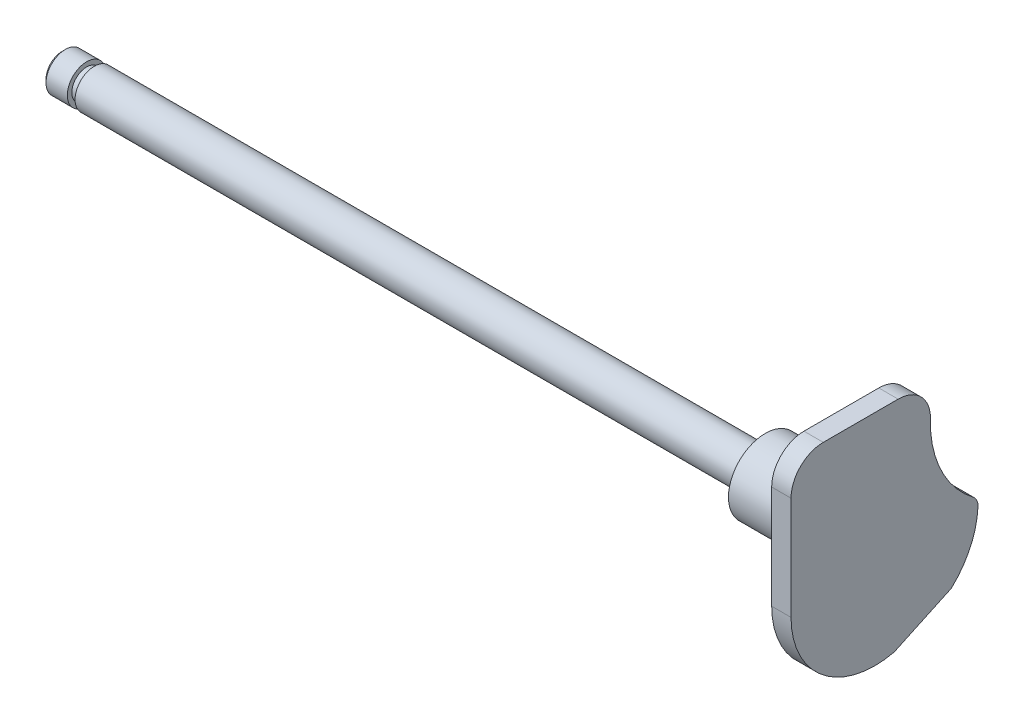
ISO-10303-21;
HEADER;
FILE_DESCRIPTION(('STEP AP214'),'2;1');
FILE_NAME('part.step','',(''),(''),'','','');
FILE_SCHEMA(('AUTOMOTIVE_DESIGN { 1 0 10303 214 1 1 1 1 }'));
ENDSEC;
DATA;
#1=APPLICATION_CONTEXT('core data for automotive mechanical design processes');
#2=APPLICATION_PROTOCOL_DEFINITION('international standard','automotive_design',2000,#1);
#3=PRODUCT_CONTEXT('',#1,'mechanical');
#4=PRODUCT('Part','Part','',(#3));
#5=PRODUCT_RELATED_PRODUCT_CATEGORY('part','',(#4));
#6=PRODUCT_DEFINITION_FORMATION('','',#4);
#7=PRODUCT_DEFINITION_CONTEXT('part definition',#1,'design');
#8=PRODUCT_DEFINITION('design','',#6,#7);
#9=PRODUCT_DEFINITION_SHAPE('','',#8);
#10=(LENGTH_UNIT() NAMED_UNIT(*) SI_UNIT(.MILLI.,.METRE.));
#11=(NAMED_UNIT(*) PLANE_ANGLE_UNIT() SI_UNIT($,.RADIAN.));
#12=(NAMED_UNIT(*) SI_UNIT($,.STERADIAN.) SOLID_ANGLE_UNIT());
#13=UNCERTAINTY_MEASURE_WITH_UNIT(LENGTH_MEASURE(1.E-05),#10,'distance_accuracy_value','');
#14=(GEOMETRIC_REPRESENTATION_CONTEXT(3) GLOBAL_UNCERTAINTY_ASSIGNED_CONTEXT((#13)) GLOBAL_UNIT_ASSIGNED_CONTEXT((#10,
#11,#12)) REPRESENTATION_CONTEXT('',''));
#15=CARTESIAN_POINT('',(0.,0.,0.));
#16=DIRECTION('',(0.,0.,1.));
#17=DIRECTION('',(1.,0.,0.));
#18=AXIS2_PLACEMENT_3D('',#15,#16,#17);
#19=CARTESIAN_POINT('',(-64.5,0.,0.));
#20=DIRECTION('',(1.,0.,0.));
#21=DIRECTION('',(0.,0.,-1.));
#22=AXIS2_PLACEMENT_3D('',#19,#20,#21);
#23=CYLINDRICAL_SURFACE('',#22,1.5);
#24=CARTESIAN_POINT('',(-10.,0.,0.));
#25=DIRECTION('',(-1.,0.,0.));
#26=DIRECTION('',(0.,0.,1.));
#27=AXIS2_PLACEMENT_3D('',#24,#25,#26);
#28=CIRCLE('',#27,1.5);
#29=CARTESIAN_POINT('',(-10.,0.,1.5));
#30=VERTEX_POINT('',#29);
#31=EDGE_CURVE('E262',#30,#30,#28,.T.);
#32=ORIENTED_EDGE('',*,*,#31,.T.);
#33=EDGE_LOOP('',(#32));
#34=FACE_BOUND('',#33,.T.);
#35=CARTESIAN_POINT('',(-62.,0.,0.));
#36=DIRECTION('',(1.,0.,0.));
#37=DIRECTION('',(0.,0.,-1.));
#38=AXIS2_PLACEMENT_3D('',#35,#36,#37);
#39=CIRCLE('',#38,1.5);
#40=CARTESIAN_POINT('',(-62.,0.,-1.5));
#41=VERTEX_POINT('',#40);
#42=EDGE_CURVE('E269',#41,#41,#39,.T.);
#43=ORIENTED_EDGE('',*,*,#42,.T.);
#44=EDGE_LOOP('',(#43));
#45=FACE_BOUND('',#44,.T.);
#46=ADVANCED_FACE('F33',(#34,#45),#23,.T.);
#47=CARTESIAN_POINT('',(-10.,0.,0.));
#48=DIRECTION('',(-1.,0.,0.));
#49=DIRECTION('',(0.,0.,1.));
#50=AXIS2_PLACEMENT_3D('',#47,#48,#49);
#51=PLANE('',#50);
#52=CARTESIAN_POINT('',(-10.,0.,0.));
#53=DIRECTION('',(-1.,0.,0.));
#54=DIRECTION('',(0.,0.,1.));
#55=AXIS2_PLACEMENT_3D('',#52,#53,#54);
#56=CIRCLE('',#55,2.85);
#57=CARTESIAN_POINT('',(-10.,0.,2.85));
#58=VERTEX_POINT('',#57);
#59=EDGE_CURVE('E144',#58,#58,#56,.T.);
#60=ORIENTED_EDGE('',*,*,#59,.T.);
#61=EDGE_LOOP('',(#60));
#62=FACE_BOUND('',#61,.T.);
#63=ORIENTED_EDGE('',*,*,#31,.F.);
#64=EDGE_LOOP('',(#63));
#65=FACE_BOUND('',#64,.T.);
#66=ADVANCED_FACE('F192',(#62,#65),#51,.T.);
#67=CARTESIAN_POINT('',(-1.5,-0.269578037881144,-5.49338945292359));
#68=DIRECTION('',(-1.,0.,0.));
#69=DIRECTION('',(0.,0.,1.));
#70=AXIS2_PLACEMENT_3D('',#67,#68,#69);
#71=PLANE('',#70);
#72=CARTESIAN_POINT('',(-1.5,-0.269578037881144,-5.49338945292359));
#73=DIRECTION('',(1.,0.,0.));
#74=DIRECTION('',(0.,0.,1.));
#75=AXIS2_PLACEMENT_3D('',#72,#73,#74);
#76=CIRCLE('',#75,0.999999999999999);
#77=CARTESIAN_POINT('',(-1.5,-0.318592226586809,-6.49218753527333));
#78=VERTEX_POINT('',#77);
#79=CARTESIAN_POINT('',(-1.5,0.525057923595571,-6.10047568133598));
#80=VERTEX_POINT('',#79);
#81=EDGE_CURVE('E165',#78,#80,#76,.T.);
#82=ORIENTED_EDGE('',*,*,#81,.F.);
#83=CARTESIAN_POINT('',(-1.5,0.,0.));
#84=DIRECTION('',(1.,0.,0.));
#85=DIRECTION('',(0.,0.,-1.));
#86=AXIS2_PLACEMENT_3D('',#83,#84,#85);
#87=CIRCLE('',#86,6.5);
#88=CARTESIAN_POINT('',(-1.5,-4.76105051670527,-4.42520033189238));
#89=VERTEX_POINT('',#88);
#90=EDGE_CURVE('E130',#89,#78,#87,.T.);
#91=ORIENTED_EDGE('',*,*,#90,.F.);
#92=DIRECTION('',(0.,0.422618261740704,-0.906307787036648));
#93=VECTOR('',#92,1.);
#94=CARTESIAN_POINT('',(-1.5,-6.82455532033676,0.));
#95=LINE('',#94,#93);
#96=CARTESIAN_POINT('',(-1.5,-6.82455532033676,0.));
#97=VERTEX_POINT('',#96);
#98=EDGE_CURVE('E114',#97,#89,#95,.T.);
#99=ORIENTED_EDGE('',*,*,#98,.F.);
#100=CARTESIAN_POINT('',(-1.5,-0.5,1.5));
#101=DIRECTION('',(1.,0.,0.));
#102=DIRECTION('',(0.,0.,-1.));
#103=AXIS2_PLACEMENT_3D('',#100,#101,#102);
#104=CIRCLE('',#103,6.5);
#105=CARTESIAN_POINT('',(-1.5,-0.500000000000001,8.));
#106=VERTEX_POINT('',#105);
#107=EDGE_CURVE('E128',#106,#97,#104,.T.);
#108=ORIENTED_EDGE('',*,*,#107,.F.);
#109=DIRECTION('',(0.,-1.,0.));
#110=VECTOR('',#109,1.);
#111=CARTESIAN_POINT('',(-1.5,7.5,8.));
#112=LINE('',#111,#110);
#113=CARTESIAN_POINT('',(-1.5,7.5,8.));
#114=VERTEX_POINT('',#113);
#115=EDGE_CURVE('E133',#114,#106,#112,.T.);
#116=ORIENTED_EDGE('',*,*,#115,.F.);
#117=CARTESIAN_POINT('',(-1.5,7.5,5.5));
#118=DIRECTION('',(1.,0.,0.));
#119=DIRECTION('',(0.,0.,-1.));
#120=AXIS2_PLACEMENT_3D('',#117,#118,#119);
#121=CIRCLE('',#120,2.5);
#122=CARTESIAN_POINT('',(-1.5,10.,5.5));
#123=VERTEX_POINT('',#122);
#124=EDGE_CURVE('E135',#123,#114,#121,.T.);
#125=ORIENTED_EDGE('',*,*,#124,.F.);
#126=DIRECTION('',(0.,0.,1.));
#127=VECTOR('',#126,1.);
#128=CARTESIAN_POINT('',(-1.5,10.,5.5));
#129=LINE('',#128,#127);
#130=CARTESIAN_POINT('',(-1.5,10.,-0.304129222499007));
#131=VERTEX_POINT('',#130);
#132=EDGE_CURVE('E250',#131,#123,#129,.T.);
#133=ORIENTED_EDGE('',*,*,#132,.F.);
#134=CARTESIAN_POINT('',(-1.5,7.5,-0.304129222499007));
#135=DIRECTION('',(1.,0.,0.));
#136=DIRECTION('',(0.,0.,-1.));
#137=AXIS2_PLACEMENT_3D('',#134,#135,#136);
#138=CIRCLE('',#137,2.5);
#139=CARTESIAN_POINT('',(-1.5,7.43119266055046,-2.8031821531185));
#140=VERTEX_POINT('',#139);
#141=EDGE_CURVE('E251',#140,#131,#138,.T.);
#142=ORIENTED_EDGE('',*,*,#141,.F.);
#143=CARTESIAN_POINT('',(-1.5,7.2,-11.2));
#144=DIRECTION('',(-1.,0.,0.));
#145=DIRECTION('',(0.,0.,-1.));
#146=AXIS2_PLACEMENT_3D('',#143,#144,#145);
#147=CIRCLE('',#146,8.4);
#148=EDGE_CURVE('E256',#80,#140,#147,.T.);
#149=ORIENTED_EDGE('',*,*,#148,.F.);
#150=EDGE_LOOP('',(#82,#91,#99,#108,#116,#125,#133,#142,#149));
#151=FACE_BOUND('',#150,.T.);
#152=CARTESIAN_POINT('',(-1.5,0.,0.));
#153=DIRECTION('',(-1.,0.,0.));
#154=DIRECTION('',(0.,0.,1.));
#155=AXIS2_PLACEMENT_3D('',#152,#153,#154);
#156=CIRCLE('',#155,2.85);
#157=CARTESIAN_POINT('',(-1.5,0.,2.85));
#158=VERTEX_POINT('',#157);
#159=EDGE_CURVE('E259',#158,#158,#156,.T.);
#160=ORIENTED_EDGE('',*,*,#159,.F.);
#161=EDGE_LOOP('',(#160));
#162=FACE_BOUND('',#161,.T.);
#163=ADVANCED_FACE('F125',(#151,#162),#71,.T.);
#164=CARTESIAN_POINT('',(-1.5,-0.269578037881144,-5.49338945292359));
#165=DIRECTION('',(1.,0.,0.));
#166=DIRECTION('',(0.,0.,-1.));
#167=AXIS2_PLACEMENT_3D('',#164,#165,#166);
#168=CYLINDRICAL_SURFACE('',#167,0.999999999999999);
#169=CARTESIAN_POINT('',(0.,-0.269578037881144,-5.49338945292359));
#170=DIRECTION('',(1.,0.,0.));
#171=DIRECTION('',(0.,0.,1.));
#172=AXIS2_PLACEMENT_3D('',#169,#170,#171);
#173=CIRCLE('',#172,0.999999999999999);
#174=CARTESIAN_POINT('',(0.,-0.318592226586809,-6.49218753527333));
#175=VERTEX_POINT('',#174);
#176=CARTESIAN_POINT('',(0.,0.525057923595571,-6.10047568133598));
#177=VERTEX_POINT('',#176);
#178=EDGE_CURVE('E140',#175,#177,#173,.T.);
#179=ORIENTED_EDGE('',*,*,#178,.F.);
#180=DIRECTION('',(1.,0.,0.));
#181=VECTOR('',#180,1.);
#182=CARTESIAN_POINT('',(-1.5,-0.318592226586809,-6.49218753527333));
#183=LINE('',#182,#181);
#184=EDGE_CURVE('E50',#78,#175,#183,.T.);
#185=ORIENTED_EDGE('',*,*,#184,.F.);
#186=ORIENTED_EDGE('',*,*,#81,.T.);
#187=DIRECTION('',(1.,0.,0.));
#188=VECTOR('',#187,1.);
#189=CARTESIAN_POINT('',(-1.5,0.525057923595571,-6.10047568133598));
#190=LINE('',#189,#188);
#191=EDGE_CURVE('E94',#80,#177,#190,.T.);
#192=ORIENTED_EDGE('',*,*,#191,.T.);
#193=EDGE_LOOP('',(#179,#185,#186,#192));
#194=FACE_BOUND('',#193,.T.);
#195=ADVANCED_FACE('F212',(#194),#168,.T.);
#196=CARTESIAN_POINT('',(-1.5,0.,0.));
#197=DIRECTION('',(1.,0.,0.));
#198=DIRECTION('',(0.,0.,-1.));
#199=AXIS2_PLACEMENT_3D('',#196,#197,#198);
#200=CYLINDRICAL_SURFACE('',#199,6.5);
#201=CARTESIAN_POINT('',(0.,0.,0.));
#202=DIRECTION('',(1.,0.,0.));
#203=DIRECTION('',(0.,0.,-1.));
#204=AXIS2_PLACEMENT_3D('',#201,#202,#203);
#205=CIRCLE('',#204,6.5);
#206=CARTESIAN_POINT('',(0.,-4.76105051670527,-4.42520033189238));
#207=VERTEX_POINT('',#206);
#208=EDGE_CURVE('E162',#207,#175,#205,.T.);
#209=ORIENTED_EDGE('',*,*,#208,.F.);
#210=DIRECTION('',(1.,0.,0.));
#211=VECTOR('',#210,1.);
#212=CARTESIAN_POINT('',(-1.5,-4.76105051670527,-4.42520033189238));
#213=LINE('',#212,#211);
#214=EDGE_CURVE('E82',#89,#207,#213,.T.);
#215=ORIENTED_EDGE('',*,*,#214,.F.);
#216=ORIENTED_EDGE('',*,*,#90,.T.);
#217=ORIENTED_EDGE('',*,*,#184,.T.);
#218=EDGE_LOOP('',(#209,#215,#216,#217));
#219=FACE_BOUND('',#218,.T.);
#220=ADVANCED_FACE('F217',(#219),#200,.T.);
#221=CARTESIAN_POINT('',(-1.5,-6.82455532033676,0.));
#222=DIRECTION('',(0.,-0.906307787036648,-0.422618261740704));
#223=DIRECTION('',(0.,0.422618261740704,-0.906307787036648));
#224=AXIS2_PLACEMENT_3D('',#221,#222,#223);
#225=PLANE('',#224);
#226=DIRECTION('',(0.,0.422618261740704,-0.906307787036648));
#227=VECTOR('',#226,1.);
#228=CARTESIAN_POINT('',(0.,-6.82455532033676,0.));
#229=LINE('',#228,#227);
#230=CARTESIAN_POINT('',(0.,-6.82455532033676,0.));
#231=VERTEX_POINT('',#230);
#232=EDGE_CURVE('E116',#231,#207,#229,.T.);
#233=ORIENTED_EDGE('',*,*,#232,.F.);
#234=DIRECTION('',(1.,0.,0.));
#235=VECTOR('',#234,1.);
#236=CARTESIAN_POINT('',(-1.5,-6.82455532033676,0.));
#237=LINE('',#236,#235);
#238=EDGE_CURVE('E111',#97,#231,#237,.T.);
#239=ORIENTED_EDGE('',*,*,#238,.F.);
#240=ORIENTED_EDGE('',*,*,#98,.T.);
#241=ORIENTED_EDGE('',*,*,#214,.T.);
#242=EDGE_LOOP('',(#233,#239,#240,#241));
#243=FACE_BOUND('',#242,.T.);
#244=ADVANCED_FACE('F113',(#243),#225,.T.);
#245=CARTESIAN_POINT('',(-1.5,-0.5,1.5));
#246=DIRECTION('',(1.,0.,0.));
#247=DIRECTION('',(0.,0.,-1.));
#248=AXIS2_PLACEMENT_3D('',#245,#246,#247);
#249=CYLINDRICAL_SURFACE('',#248,6.5);
#250=CARTESIAN_POINT('',(0.,-0.5,1.5));
#251=DIRECTION('',(1.,0.,0.));
#252=DIRECTION('',(0.,0.,-1.));
#253=AXIS2_PLACEMENT_3D('',#250,#251,#252);
#254=CIRCLE('',#253,6.5);
#255=CARTESIAN_POINT('',(0.,-0.500000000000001,8.));
#256=VERTEX_POINT('',#255);
#257=EDGE_CURVE('E159',#256,#231,#254,.T.);
#258=ORIENTED_EDGE('',*,*,#257,.F.);
#259=DIRECTION('',(1.,0.,0.));
#260=VECTOR('',#259,1.);
#261=CARTESIAN_POINT('',(-1.5,-0.500000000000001,8.));
#262=LINE('',#261,#260);
#263=EDGE_CURVE('E121',#106,#256,#262,.T.);
#264=ORIENTED_EDGE('',*,*,#263,.F.);
#265=ORIENTED_EDGE('',*,*,#107,.T.);
#266=ORIENTED_EDGE('',*,*,#238,.T.);
#267=EDGE_LOOP('',(#258,#264,#265,#266));
#268=FACE_BOUND('',#267,.T.);
#269=ADVANCED_FACE('F132',(#268),#249,.T.);
#270=CARTESIAN_POINT('',(-1.5,7.5,8.));
#271=DIRECTION('',(0.,0.,1.));
#272=DIRECTION('',(0.,-1.,0.));
#273=AXIS2_PLACEMENT_3D('',#270,#271,#272);
#274=PLANE('',#273);
#275=DIRECTION('',(0.,-1.,0.));
#276=VECTOR('',#275,1.);
#277=CARTESIAN_POINT('',(0.,7.5,8.));
#278=LINE('',#277,#276);
#279=CARTESIAN_POINT('',(0.,7.5,8.));
#280=VERTEX_POINT('',#279);
#281=EDGE_CURVE('E156',#280,#256,#278,.T.);
#282=ORIENTED_EDGE('',*,*,#281,.F.);
#283=DIRECTION('',(1.,0.,0.));
#284=VECTOR('',#283,1.);
#285=CARTESIAN_POINT('',(-1.5,7.5,8.));
#286=LINE('',#285,#284);
#287=EDGE_CURVE('E169',#114,#280,#286,.T.);
#288=ORIENTED_EDGE('',*,*,#287,.F.);
#289=ORIENTED_EDGE('',*,*,#115,.T.);
#290=ORIENTED_EDGE('',*,*,#263,.T.);
#291=EDGE_LOOP('',(#282,#288,#289,#290));
#292=FACE_BOUND('',#291,.T.);
#293=ADVANCED_FACE('F224',(#292),#274,.T.);
#294=CARTESIAN_POINT('',(-1.5,7.5,5.5));
#295=DIRECTION('',(1.,0.,0.));
#296=DIRECTION('',(0.,0.,-1.));
#297=AXIS2_PLACEMENT_3D('',#294,#295,#296);
#298=CYLINDRICAL_SURFACE('',#297,2.5);
#299=CARTESIAN_POINT('',(0.,7.5,5.5));
#300=DIRECTION('',(1.,0.,0.));
#301=DIRECTION('',(0.,0.,-1.));
#302=AXIS2_PLACEMENT_3D('',#299,#300,#301);
#303=CIRCLE('',#302,2.5);
#304=CARTESIAN_POINT('',(0.,10.,5.5));
#305=VERTEX_POINT('',#304);
#306=EDGE_CURVE('E153',#305,#280,#303,.T.);
#307=ORIENTED_EDGE('',*,*,#306,.F.);
#308=DIRECTION('',(1.,0.,0.));
#309=VECTOR('',#308,1.);
#310=CARTESIAN_POINT('',(-1.5,10.,5.5));
#311=LINE('',#310,#309);
#312=EDGE_CURVE('E171',#123,#305,#311,.T.);
#313=ORIENTED_EDGE('',*,*,#312,.F.);
#314=ORIENTED_EDGE('',*,*,#124,.T.);
#315=ORIENTED_EDGE('',*,*,#287,.T.);
#316=EDGE_LOOP('',(#307,#313,#314,#315));
#317=FACE_BOUND('',#316,.T.);
#318=ADVANCED_FACE('F227',(#317),#298,.T.);
#319=CARTESIAN_POINT('',(-1.5,10.,5.5));
#320=DIRECTION('',(0.,1.,0.));
#321=DIRECTION('',(0.,0.,1.));
#322=AXIS2_PLACEMENT_3D('',#319,#320,#321);
#323=PLANE('',#322);
#324=DIRECTION('',(0.,0.,1.));
#325=VECTOR('',#324,1.);
#326=CARTESIAN_POINT('',(0.,10.,5.5));
#327=LINE('',#326,#325);
#328=CARTESIAN_POINT('',(0.,10.,-0.304129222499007));
#329=VERTEX_POINT('',#328);
#330=EDGE_CURVE('E150',#329,#305,#327,.T.);
#331=ORIENTED_EDGE('',*,*,#330,.F.);
#332=DIRECTION('',(1.,0.,0.));
#333=VECTOR('',#332,1.);
#334=CARTESIAN_POINT('',(-1.5,10.,-0.304129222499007));
#335=LINE('',#334,#333);
#336=EDGE_CURVE('E173',#131,#329,#335,.T.);
#337=ORIENTED_EDGE('',*,*,#336,.F.);
#338=ORIENTED_EDGE('',*,*,#132,.T.);
#339=ORIENTED_EDGE('',*,*,#312,.T.);
#340=EDGE_LOOP('',(#331,#337,#338,#339));
#341=FACE_BOUND('',#340,.T.);
#342=ADVANCED_FACE('F231',(#341),#323,.T.);
#343=CARTESIAN_POINT('',(-1.5,7.5,-0.304129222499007));
#344=DIRECTION('',(1.,0.,0.));
#345=DIRECTION('',(0.,0.,-1.));
#346=AXIS2_PLACEMENT_3D('',#343,#344,#345);
#347=CYLINDRICAL_SURFACE('',#346,2.5);
#348=CARTESIAN_POINT('',(0.,7.5,-0.304129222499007));
#349=DIRECTION('',(1.,0.,0.));
#350=DIRECTION('',(0.,0.,-1.));
#351=AXIS2_PLACEMENT_3D('',#348,#349,#350);
#352=CIRCLE('',#351,2.5);
#353=CARTESIAN_POINT('',(0.,7.43119266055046,-2.8031821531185));
#354=VERTEX_POINT('',#353);
#355=EDGE_CURVE('E147',#354,#329,#352,.T.);
#356=ORIENTED_EDGE('',*,*,#355,.F.);
#357=DIRECTION('',(1.,0.,0.));
#358=VECTOR('',#357,1.);
#359=CARTESIAN_POINT('',(-1.5,7.43119266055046,-2.8031821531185));
#360=LINE('',#359,#358);
#361=EDGE_CURVE('E175',#140,#354,#360,.T.);
#362=ORIENTED_EDGE('',*,*,#361,.F.);
#363=ORIENTED_EDGE('',*,*,#141,.T.);
#364=ORIENTED_EDGE('',*,*,#336,.T.);
#365=EDGE_LOOP('',(#356,#362,#363,#364));
#366=FACE_BOUND('',#365,.T.);
#367=ADVANCED_FACE('F235',(#366),#347,.T.);
#368=CARTESIAN_POINT('',(-1.5,7.2,-11.2));
#369=DIRECTION('',(1.,0.,0.));
#370=DIRECTION('',(0.,0.,-1.));
#371=AXIS2_PLACEMENT_3D('',#368,#369,#370);
#372=CYLINDRICAL_SURFACE('',#371,8.4);
#373=CARTESIAN_POINT('',(0.,7.2,-11.2));
#374=DIRECTION('',(-1.,0.,0.));
#375=DIRECTION('',(0.,0.,-1.));
#376=AXIS2_PLACEMENT_3D('',#373,#374,#375);
#377=CIRCLE('',#376,8.4);
#378=EDGE_CURVE('E143',#177,#354,#377,.T.);
#379=ORIENTED_EDGE('',*,*,#378,.F.);
#380=ORIENTED_EDGE('',*,*,#191,.F.);
#381=ORIENTED_EDGE('',*,*,#148,.T.);
#382=ORIENTED_EDGE('',*,*,#361,.T.);
#383=EDGE_LOOP('',(#379,#380,#381,#382));
#384=FACE_BOUND('',#383,.T.);
#385=ADVANCED_FACE('F215',(#384),#372,.F.);
#386=CARTESIAN_POINT('',(0.,-0.269578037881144,-5.49338945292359));
#387=DIRECTION('',(-1.,0.,0.));
#388=DIRECTION('',(0.,0.,1.));
#389=AXIS2_PLACEMENT_3D('',#386,#387,#388);
#390=PLANE('',#389);
#391=ORIENTED_EDGE('',*,*,#178,.T.);
#392=ORIENTED_EDGE('',*,*,#378,.T.);
#393=ORIENTED_EDGE('',*,*,#355,.T.);
#394=ORIENTED_EDGE('',*,*,#330,.T.);
#395=ORIENTED_EDGE('',*,*,#306,.T.);
#396=ORIENTED_EDGE('',*,*,#281,.T.);
#397=ORIENTED_EDGE('',*,*,#257,.T.);
#398=ORIENTED_EDGE('',*,*,#232,.T.);
#399=ORIENTED_EDGE('',*,*,#208,.T.);
#400=EDGE_LOOP('',(#391,#392,#393,#394,#395,#396,#397,#398,#399));
#401=FACE_BOUND('',#400,.T.);
#402=ADVANCED_FACE('F208',(#401),#390,.F.);
#403=CARTESIAN_POINT('',(-10.,0.,0.));
#404=DIRECTION('',(1.,0.,0.));
#405=DIRECTION('',(0.,0.,-1.));
#406=AXIS2_PLACEMENT_3D('',#403,#404,#405);
#407=CYLINDRICAL_SURFACE('',#406,2.85);
#408=ORIENTED_EDGE('',*,*,#59,.F.);
#409=EDGE_LOOP('',(#408));
#410=FACE_BOUND('',#409,.T.);
#411=ORIENTED_EDGE('',*,*,#159,.T.);
#412=EDGE_LOOP('',(#411));
#413=FACE_BOUND('',#412,.T.);
#414=ADVANCED_FACE('F204',(#410,#413),#407,.T.);
#415=CARTESIAN_POINT('',(-62.6,-1.15000000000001,0.));
#416=DIRECTION('',(1.,0.,0.));
#417=DIRECTION('',(0.,0.,-1.));
#418=AXIS2_PLACEMENT_3D('',#415,#416,#417);
#419=PLANE('',#418);
#420=CARTESIAN_POINT('',(-62.6,0.,0.));
#421=DIRECTION('',(1.,0.,0.));
#422=DIRECTION('',(0.,0.,-1.));
#423=AXIS2_PLACEMENT_3D('',#420,#421,#422);
#424=CIRCLE('',#423,1.5);
#425=CARTESIAN_POINT('',(-62.6,0.,-1.5));
#426=VERTEX_POINT('',#425);
#427=EDGE_CURVE('E266',#426,#426,#424,.T.);
#428=ORIENTED_EDGE('',*,*,#427,.T.);
#429=EDGE_LOOP('',(#428));
#430=FACE_BOUND('',#429,.T.);
#431=CARTESIAN_POINT('',(-62.6,0.,0.));
#432=DIRECTION('',(1.,0.,0.));
#433=DIRECTION('',(0.,0.,-1.));
#434=AXIS2_PLACEMENT_3D('',#431,#432,#433);
#435=CIRCLE('',#434,1.15000000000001);
#436=CARTESIAN_POINT('',(-62.6,0.,-1.15000000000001));
#437=VERTEX_POINT('',#436);
#438=EDGE_CURVE('E275',#437,#437,#435,.T.);
#439=ORIENTED_EDGE('',*,*,#438,.F.);
#440=EDGE_LOOP('',(#439));
#441=FACE_BOUND('',#440,.T.);
#442=ADVANCED_FACE('F207',(#430,#441),#419,.T.);
#443=CARTESIAN_POINT('',(-62.,-1.15000000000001,0.));
#444=DIRECTION('',(-1.,0.,0.));
#445=DIRECTION('',(0.,0.,1.));
#446=AXIS2_PLACEMENT_3D('',#443,#444,#445);
#447=PLANE('',#446);
#448=CARTESIAN_POINT('',(-62.,0.,0.));
#449=DIRECTION('',(1.,0.,0.));
#450=DIRECTION('',(0.,0.,-1.));
#451=AXIS2_PLACEMENT_3D('',#448,#449,#450);
#452=CIRCLE('',#451,1.15000000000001);
#453=CARTESIAN_POINT('',(-62.,0.,-1.15000000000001));
#454=VERTEX_POINT('',#453);
#455=EDGE_CURVE('E272',#454,#454,#452,.T.);
#456=ORIENTED_EDGE('',*,*,#455,.T.);
#457=EDGE_LOOP('',(#456));
#458=FACE_BOUND('',#457,.T.);
#459=ORIENTED_EDGE('',*,*,#42,.F.);
#460=EDGE_LOOP('',(#459));
#461=FACE_BOUND('',#460,.T.);
#462=ADVANCED_FACE('F283',(#458,#461),#447,.T.);
#463=CARTESIAN_POINT('',(2.57959850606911,0.,0.));
#464=DIRECTION('',(1.,0.,0.));
#465=DIRECTION('',(0.,0.,-1.));
#466=AXIS2_PLACEMENT_3D('',#463,#464,#465);
#467=CYLINDRICAL_SURFACE('',#466,1.15000000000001);
#468=ORIENTED_EDGE('',*,*,#438,.T.);
#469=EDGE_LOOP('',(#468));
#470=FACE_BOUND('',#469,.T.);
#471=ORIENTED_EDGE('',*,*,#455,.F.);
#472=EDGE_LOOP('',(#471));
#473=FACE_BOUND('',#472,.T.);
#474=ADVANCED_FACE('F279',(#470,#473),#467,.T.);
#475=CARTESIAN_POINT('',(-64.5,0.,0.));
#476=DIRECTION('',(-1.,0.,0.));
#477=DIRECTION('',(0.,0.,1.));
#478=AXIS2_PLACEMENT_3D('',#475,#476,#477);
#479=PLANE('',#478);
#480=CARTESIAN_POINT('',(-64.5,0.,0.));
#481=DIRECTION('',(-1.,0.,0.));
#482=DIRECTION('',(0.,0.,1.));
#483=AXIS2_PLACEMENT_3D('',#480,#481,#482);
#484=CIRCLE('',#483,1.25);
#485=CARTESIAN_POINT('',(-64.5,0.,1.25));
#486=VERTEX_POINT('',#485);
#487=EDGE_CURVE('E42',#486,#486,#484,.T.);
#488=ORIENTED_EDGE('',*,*,#487,.T.);
#489=EDGE_LOOP('',(#488));
#490=FACE_BOUND('',#489,.T.);
#491=ADVANCED_FACE('F180',(#490),#479,.T.);
#492=CARTESIAN_POINT('',(-64.25,0.,0.));
#493=DIRECTION('',(-1.,0.,0.));
#494=DIRECTION('',(0.,0.,1.));
#495=AXIS2_PLACEMENT_3D('',#492,#493,#494);
#496=CIRCLE('',#495,1.5);
#497=CARTESIAN_POINT('',(-64.25,0.,1.5));
#498=VERTEX_POINT('',#497);
#499=EDGE_CURVE('E11',#498,#498,#496,.F.);
#500=ORIENTED_EDGE('',*,*,#499,.T.);
#501=EDGE_LOOP('',(#500));
#502=FACE_BOUND('',#501,.T.);
#503=ORIENTED_EDGE('',*,*,#427,.F.);
#504=EDGE_LOOP('',(#503));
#505=FACE_BOUND('',#504,.T.);
#506=ADVANCED_FACE('F183',(#502,#505),#23,.T.);
#507=CARTESIAN_POINT('',(-64.5,0.,0.));
#508=DIRECTION('',(1.,0.,0.));
#509=DIRECTION('',(0.,0.,-1.));
#510=AXIS2_PLACEMENT_3D('',#507,#508,#509);
#511=CONICAL_SURFACE('',#510,1.25,0.785398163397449);
#512=ORIENTED_EDGE('',*,*,#499,.F.);
#513=EDGE_LOOP('',(#512));
#514=FACE_BOUND('',#513,.T.);
#515=ORIENTED_EDGE('',*,*,#487,.F.);
#516=EDGE_LOOP('',(#515));
#517=FACE_BOUND('',#516,.T.);
#518=ADVANCED_FACE('F35',(#514,#517),#511,.T.);
#519=CLOSED_SHELL('',(#46,#66,#163,#195,#220,#244,#269,#293,#318,#342,#367,#385,#402,#414,#442,
#462,#474,#491,#506,#518));
#520=MANIFOLD_SOLID_BREP('B2',#519);
#521=ADVANCED_BREP_SHAPE_REPRESENTATION('',(#18,#520),#14);
#522=SHAPE_DEFINITION_REPRESENTATION(#9,#521);
ENDSEC;
END-ISO-10303-21;
